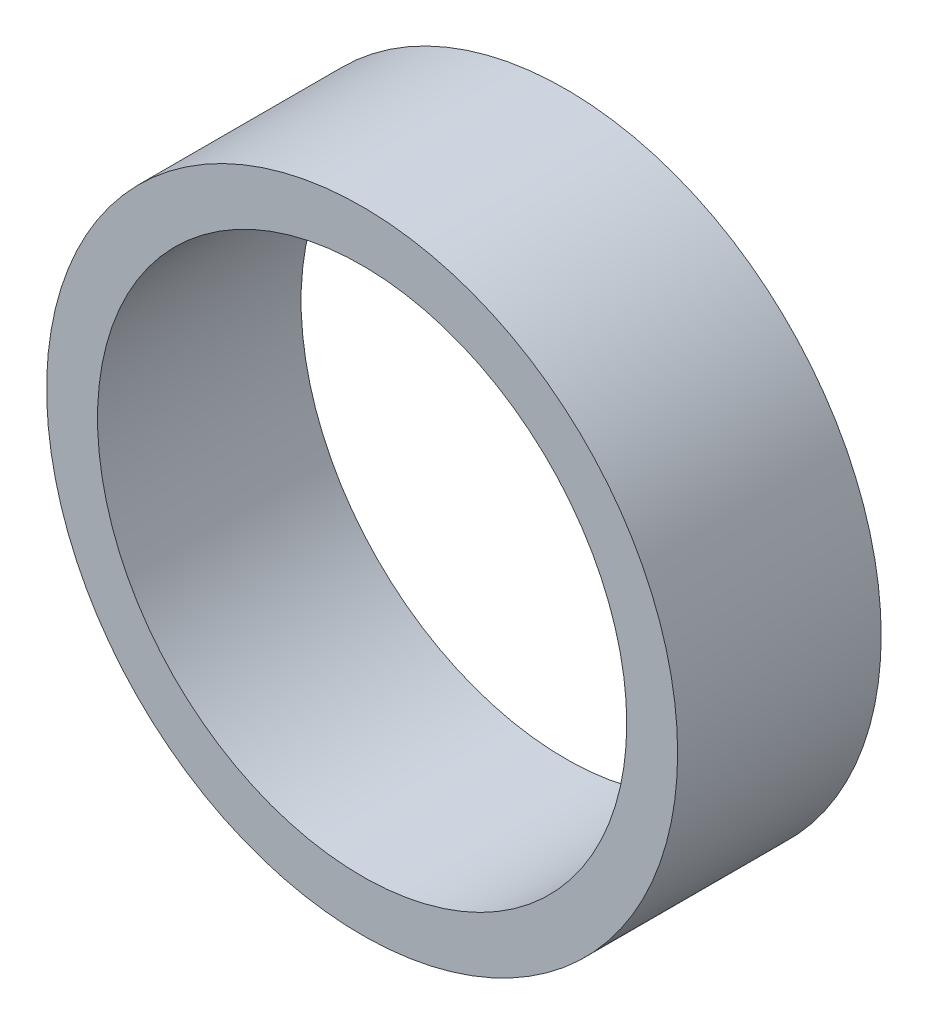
ISO-10303-21;
HEADER;
FILE_DESCRIPTION(('STEP AP214'),'2;1');
FILE_NAME('part.step','',(''),(''),'','','');
FILE_SCHEMA(('AUTOMOTIVE_DESIGN { 1 0 10303 214 1 1 1 1 }'));
ENDSEC;
DATA;
#1=APPLICATION_CONTEXT('core data for automotive mechanical design processes');
#2=APPLICATION_PROTOCOL_DEFINITION('international standard','automotive_design',2000,#1);
#3=PRODUCT_CONTEXT('',#1,'mechanical');
#4=PRODUCT('Part','Part','',(#3));
#5=PRODUCT_RELATED_PRODUCT_CATEGORY('part','',(#4));
#6=PRODUCT_DEFINITION_FORMATION('','',#4);
#7=PRODUCT_DEFINITION_CONTEXT('part definition',#1,'design');
#8=PRODUCT_DEFINITION('design','',#6,#7);
#9=PRODUCT_DEFINITION_SHAPE('','',#8);
#10=(LENGTH_UNIT() NAMED_UNIT(*) SI_UNIT(.MILLI.,.METRE.));
#11=(NAMED_UNIT(*) PLANE_ANGLE_UNIT() SI_UNIT($,.RADIAN.));
#12=(NAMED_UNIT(*) SI_UNIT($,.STERADIAN.) SOLID_ANGLE_UNIT());
#13=UNCERTAINTY_MEASURE_WITH_UNIT(LENGTH_MEASURE(1.E-05),#10,'distance_accuracy_value','');
#14=(GEOMETRIC_REPRESENTATION_CONTEXT(3) GLOBAL_UNCERTAINTY_ASSIGNED_CONTEXT((#13)) GLOBAL_UNIT_ASSIGNED_CONTEXT((#10,
#11,#12)) REPRESENTATION_CONTEXT('',''));
#15=CARTESIAN_POINT('',(0.,0.,0.));
#16=DIRECTION('',(0.,0.,1.));
#17=DIRECTION('',(1.,0.,0.));
#18=AXIS2_PLACEMENT_3D('',#15,#16,#17);
#19=CARTESIAN_POINT('',(0.,0.,20.));
#20=DIRECTION('',(0.,0.,1.));
#21=DIRECTION('',(1.,0.,0.));
#22=AXIS2_PLACEMENT_3D('',#19,#20,#21);
#23=PLANE('',#22);
#24=CARTESIAN_POINT('',(0.,0.,20.));
#25=DIRECTION('',(0.,0.,1.));
#26=DIRECTION('',(1.,0.,0.));
#27=AXIS2_PLACEMENT_3D('',#24,#25,#26);
#28=CIRCLE('',#27,31.);
#29=CARTESIAN_POINT('',(31.,0.,20.));
#30=VERTEX_POINT('',#29);
#31=EDGE_CURVE('E10',#30,#30,#28,.T.);
#32=ORIENTED_EDGE('',*,*,#31,.T.);
#33=EDGE_LOOP('',(#32));
#34=FACE_BOUND('',#33,.T.);
#35=CARTESIAN_POINT('',(0.,0.,20.));
#36=DIRECTION('',(0.,0.,1.));
#37=DIRECTION('',(1.,0.,0.));
#38=AXIS2_PLACEMENT_3D('',#35,#36,#37);
#39=CIRCLE('',#38,26.);
#40=CARTESIAN_POINT('',(26.,0.,20.));
#41=VERTEX_POINT('',#40);
#42=EDGE_CURVE('E41',#41,#41,#39,.T.);
#43=ORIENTED_EDGE('',*,*,#42,.F.);
#44=EDGE_LOOP('',(#43));
#45=FACE_BOUND('',#44,.T.);
#46=ADVANCED_FACE('F30',(#34,#45),#23,.T.);
#47=CARTESIAN_POINT('',(0.,0.,0.));
#48=DIRECTION('',(0.,0.,1.));
#49=DIRECTION('',(1.,0.,0.));
#50=AXIS2_PLACEMENT_3D('',#47,#48,#49);
#51=PLANE('',#50);
#52=CARTESIAN_POINT('',(0.,0.,0.));
#53=DIRECTION('',(0.,0.,1.));
#54=DIRECTION('',(1.,0.,0.));
#55=AXIS2_PLACEMENT_3D('',#52,#53,#54);
#56=CIRCLE('',#55,31.);
#57=CARTESIAN_POINT('',(31.,0.,0.));
#58=VERTEX_POINT('',#57);
#59=EDGE_CURVE('E34',#58,#58,#56,.T.);
#60=ORIENTED_EDGE('',*,*,#59,.F.);
#61=EDGE_LOOP('',(#60));
#62=FACE_BOUND('',#61,.T.);
#63=CARTESIAN_POINT('',(0.,0.,0.));
#64=DIRECTION('',(0.,0.,1.));
#65=DIRECTION('',(1.,0.,0.));
#66=AXIS2_PLACEMENT_3D('',#63,#64,#65);
#67=CIRCLE('',#66,26.);
#68=CARTESIAN_POINT('',(26.,0.,0.));
#69=VERTEX_POINT('',#68);
#70=EDGE_CURVE('E43',#69,#69,#67,.T.);
#71=ORIENTED_EDGE('',*,*,#70,.T.);
#72=EDGE_LOOP('',(#71));
#73=FACE_BOUND('',#72,.T.);
#74=ADVANCED_FACE('F53',(#62,#73),#51,.F.);
#75=CARTESIAN_POINT('',(0.,0.,20.));
#76=DIRECTION('',(0.,0.,-1.));
#77=DIRECTION('',(-1.,0.,0.));
#78=AXIS2_PLACEMENT_3D('',#75,#76,#77);
#79=CYLINDRICAL_SURFACE('',#78,31.);
#80=ORIENTED_EDGE('',*,*,#31,.F.);
#81=EDGE_LOOP('',(#80));
#82=FACE_BOUND('',#81,.T.);
#83=ORIENTED_EDGE('',*,*,#59,.T.);
#84=EDGE_LOOP('',(#83));
#85=FACE_BOUND('',#84,.T.);
#86=ADVANCED_FACE('F32',(#82,#85),#79,.T.);
#87=CARTESIAN_POINT('',(0.,0.,20.));
#88=DIRECTION('',(0.,0.,-1.));
#89=DIRECTION('',(-1.,0.,0.));
#90=AXIS2_PLACEMENT_3D('',#87,#88,#89);
#91=CYLINDRICAL_SURFACE('',#90,26.);
#92=ORIENTED_EDGE('',*,*,#42,.T.);
#93=EDGE_LOOP('',(#92));
#94=FACE_BOUND('',#93,.T.);
#95=ORIENTED_EDGE('',*,*,#70,.F.);
#96=EDGE_LOOP('',(#95));
#97=FACE_BOUND('',#96,.T.);
#98=ADVANCED_FACE('F49',(#94,#97),#91,.F.);
#99=CLOSED_SHELL('',(#46,#74,#86,#98));
#100=MANIFOLD_SOLID_BREP('B2',#99);
#101=ADVANCED_BREP_SHAPE_REPRESENTATION('',(#18,#100),#14);
#102=SHAPE_DEFINITION_REPRESENTATION(#9,#101);
ENDSEC;
END-ISO-10303-21;
